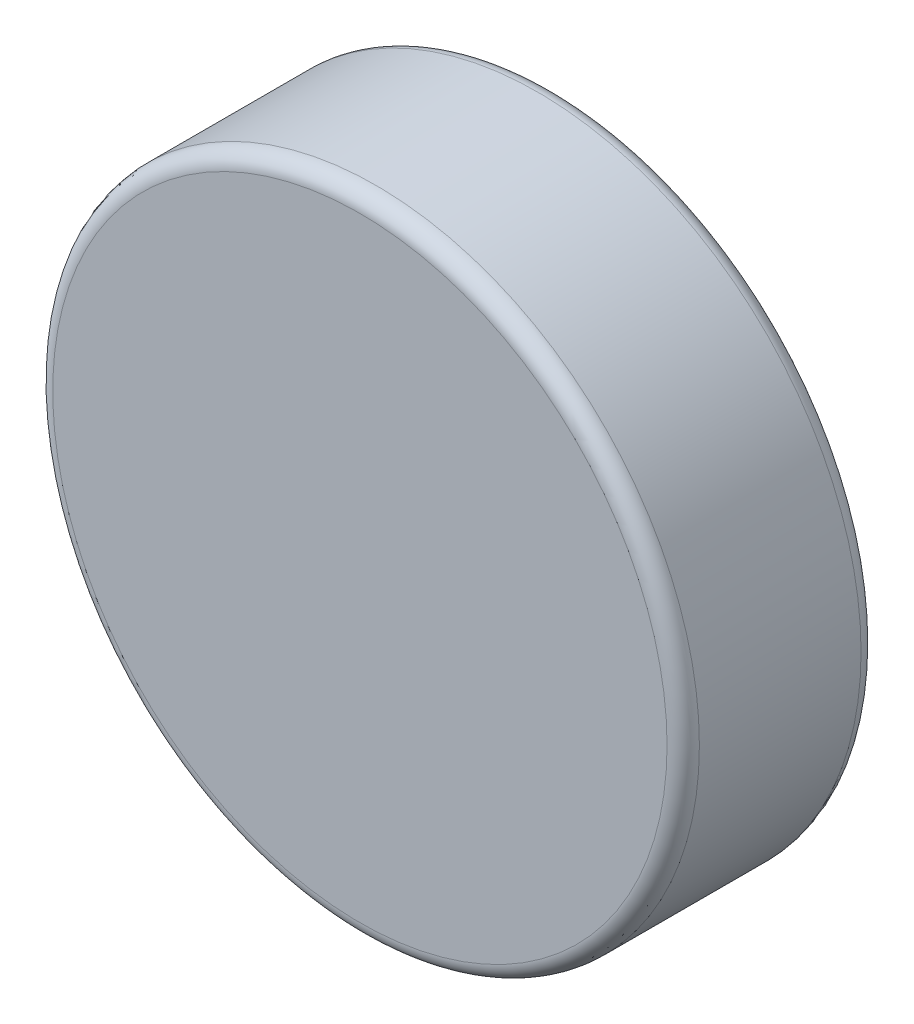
ISO-10303-21;
HEADER;
FILE_DESCRIPTION(('STEP AP214'),'2;1');
FILE_NAME('part.step','',(''),(''),'','','');
FILE_SCHEMA(('AUTOMOTIVE_DESIGN { 1 0 10303 214 1 1 1 1 }'));
ENDSEC;
DATA;
#1=APPLICATION_CONTEXT('core data for automotive mechanical design processes');
#2=APPLICATION_PROTOCOL_DEFINITION('international standard','automotive_design',2000,#1);
#3=PRODUCT_CONTEXT('',#1,'mechanical');
#4=PRODUCT('Part','Part','',(#3));
#5=PRODUCT_RELATED_PRODUCT_CATEGORY('part','',(#4));
#6=PRODUCT_DEFINITION_FORMATION('','',#4);
#7=PRODUCT_DEFINITION_CONTEXT('part definition',#1,'design');
#8=PRODUCT_DEFINITION('design','',#6,#7);
#9=PRODUCT_DEFINITION_SHAPE('','',#8);
#10=(LENGTH_UNIT() NAMED_UNIT(*) SI_UNIT(.MILLI.,.METRE.));
#11=(NAMED_UNIT(*) PLANE_ANGLE_UNIT() SI_UNIT($,.RADIAN.));
#12=(NAMED_UNIT(*) SI_UNIT($,.STERADIAN.) SOLID_ANGLE_UNIT());
#13=UNCERTAINTY_MEASURE_WITH_UNIT(LENGTH_MEASURE(1.E-05),#10,'distance_accuracy_value','');
#14=(GEOMETRIC_REPRESENTATION_CONTEXT(3) GLOBAL_UNCERTAINTY_ASSIGNED_CONTEXT((#13)) GLOBAL_UNIT_ASSIGNED_CONTEXT((#10,
#11,#12)) REPRESENTATION_CONTEXT('',''));
#15=CARTESIAN_POINT('',(0.,0.,0.));
#16=DIRECTION('',(0.,0.,1.));
#17=DIRECTION('',(1.,0.,0.));
#18=AXIS2_PLACEMENT_3D('',#15,#16,#17);
#19=CARTESIAN_POINT('',(0.,0.,3.));
#20=DIRECTION('',(0.,0.,-1.));
#21=DIRECTION('',(-1.,0.,0.));
#22=AXIS2_PLACEMENT_3D('',#19,#20,#21);
#23=CYLINDRICAL_SURFACE('',#22,5.);
#24=CARTESIAN_POINT('',(0.,0.,0.25));
#25=DIRECTION('',(0.,0.,1.));
#26=DIRECTION('',(1.,0.,0.));
#27=AXIS2_PLACEMENT_3D('',#24,#25,#26);
#28=CIRCLE('',#27,5.);
#29=CARTESIAN_POINT('',(5.,0.,0.25));
#30=VERTEX_POINT('',#29);
#31=EDGE_CURVE('E42',#30,#30,#28,.T.);
#32=ORIENTED_EDGE('',*,*,#31,.T.);
#33=EDGE_LOOP('',(#32));
#34=FACE_BOUND('',#33,.T.);
#35=CARTESIAN_POINT('',(0.,0.,2.75));
#36=DIRECTION('',(0.,0.,1.));
#37=DIRECTION('',(1.,0.,0.));
#38=AXIS2_PLACEMENT_3D('',#35,#36,#37);
#39=CIRCLE('',#38,5.);
#40=CARTESIAN_POINT('',(5.,0.,2.75));
#41=VERTEX_POINT('',#40);
#42=EDGE_CURVE('E46',#41,#41,#39,.F.);
#43=ORIENTED_EDGE('',*,*,#42,.T.);
#44=EDGE_LOOP('',(#43));
#45=FACE_BOUND('',#44,.T.);
#46=ADVANCED_FACE('F31',(#34,#45),#23,.T.);
#47=CARTESIAN_POINT('',(0.,0.,3.));
#48=DIRECTION('',(0.,0.,1.));
#49=DIRECTION('',(1.,0.,0.));
#50=AXIS2_PLACEMENT_3D('',#47,#48,#49);
#51=PLANE('',#50);
#52=CARTESIAN_POINT('',(0.,0.,3.));
#53=DIRECTION('',(0.,0.,1.));
#54=DIRECTION('',(1.,0.,0.));
#55=AXIS2_PLACEMENT_3D('',#52,#53,#54);
#56=CIRCLE('',#55,4.75);
#57=CARTESIAN_POINT('',(4.75,0.,3.));
#58=VERTEX_POINT('',#57);
#59=EDGE_CURVE('E10',#58,#58,#56,.T.);
#60=ORIENTED_EDGE('',*,*,#59,.T.);
#61=EDGE_LOOP('',(#60));
#62=FACE_BOUND('',#61,.T.);
#63=ADVANCED_FACE('F62',(#62),#51,.T.);
#64=CARTESIAN_POINT('',(0.,0.,0.));
#65=DIRECTION('',(0.,0.,1.));
#66=DIRECTION('',(1.,0.,0.));
#67=AXIS2_PLACEMENT_3D('',#64,#65,#66);
#68=PLANE('',#67);
#69=CARTESIAN_POINT('',(0.,0.,0.));
#70=DIRECTION('',(0.,0.,1.));
#71=DIRECTION('',(1.,0.,0.));
#72=AXIS2_PLACEMENT_3D('',#69,#70,#71);
#73=CIRCLE('',#72,4.75);
#74=CARTESIAN_POINT('',(4.75,0.,0.));
#75=VERTEX_POINT('',#74);
#76=EDGE_CURVE('E38',#75,#75,#73,.F.);
#77=ORIENTED_EDGE('',*,*,#76,.T.);
#78=EDGE_LOOP('',(#77));
#79=FACE_BOUND('',#78,.T.);
#80=ADVANCED_FACE('F59',(#79),#68,.F.);
#81=CARTESIAN_POINT('',(0.,0.,0.25));
#82=DIRECTION('',(0.,0.,1.));
#83=DIRECTION('',(1.,0.,0.));
#84=AXIS2_PLACEMENT_3D('',#81,#82,#83);
#85=TOROIDAL_SURFACE('',#84,4.75,0.25);
#86=ORIENTED_EDGE('',*,*,#76,.F.);
#87=EDGE_LOOP('',(#86));
#88=FACE_BOUND('',#87,.T.);
#89=ORIENTED_EDGE('',*,*,#31,.F.);
#90=EDGE_LOOP('',(#89));
#91=FACE_BOUND('',#90,.T.);
#92=ADVANCED_FACE('F55',(#88,#91),#85,.T.);
#93=CARTESIAN_POINT('',(0.,0.,2.75));
#94=DIRECTION('',(0.,0.,1.));
#95=DIRECTION('',(1.,0.,0.));
#96=AXIS2_PLACEMENT_3D('',#93,#94,#95);
#97=TOROIDAL_SURFACE('',#96,4.75,0.25);
#98=ORIENTED_EDGE('',*,*,#42,.F.);
#99=EDGE_LOOP('',(#98));
#100=FACE_BOUND('',#99,.T.);
#101=ORIENTED_EDGE('',*,*,#59,.F.);
#102=EDGE_LOOP('',(#101));
#103=FACE_BOUND('',#102,.T.);
#104=ADVANCED_FACE('F33',(#100,#103),#97,.T.);
#105=CLOSED_SHELL('',(#46,#63,#80,#92,#104));
#106=MANIFOLD_SOLID_BREP('B2',#105);
#107=ADVANCED_BREP_SHAPE_REPRESENTATION('',(#18,#106),#14);
#108=SHAPE_DEFINITION_REPRESENTATION(#9,#107);
ENDSEC;
END-ISO-10303-21;
